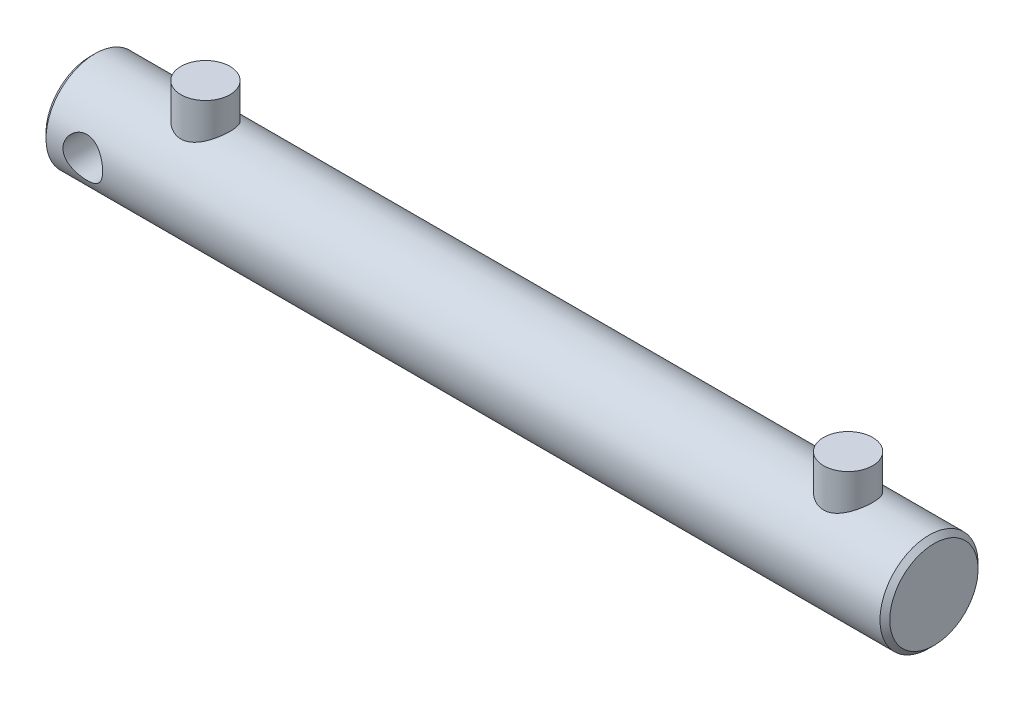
from build123d import *

# Parameters (mm, degrees)
ESQUISSE1_W                  = 344
ESQUISSE1_H                  = 20
CHANFREIN1_SIZE              = 2
ENL_V_MAT_EXTRU_1_DEPTH      = 175.310068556
ENL_V_MAT_EXTRU_1_DEPTH_BACK = 175.310068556
ESQUISSE3_R                  = 8.1
ESQUISSE5_R                  = 10
EXTRUSION2_DEPTH             = 33


with BuildPart() as part:
    # Esquisse1 → R_volution1 (revolve)
    with BuildSketch(Plane.XY, mode=Mode.PRIVATE) as r_volution1_sk:
        with Locations((0, 10)):
            Rectangle(ESQUISSE1_W, ESQUISSE1_H)
    revolve(r_volution1_sk.sketch.rotate(Axis((-172, 0, 0), (1, 0, 0)), 90), axis=Axis((-172, 0, 0), (1, 0, 0)))

    # Chanfrein1
    chanfrein1_edges = [part.edges().sort_by_distance(p)[0] for p in [
        (172, 0, -20),
        (-172, 0, -20),
    ]]
    chamfer(chanfrein1_edges, length=CHANFREIN1_SIZE)

    # Esquisse3 → Enl_v. mat.-Extru.1 (cut, two sides: drawn at the far end of the back side and taken through both)
    with BuildSketch(Plane.XY.offset(-ENL_V_MAT_EXTRU_1_DEPTH_BACK)):
        with Locations((-155, 0)):
            Circle(ESQUISSE3_R)
    extrude(amount=ENL_V_MAT_EXTRU_1_DEPTH + ENL_V_MAT_EXTRU_1_DEPTH_BACK, mode=Mode.SUBTRACT)

    # Esquisse5 → Extrusion2 (add)
    with BuildSketch(Plane(origin=(0, 0, 0), x_dir=(1, 0, 0), z_dir=(0, 1, 0))):
        with Locations(Location((-125, 0, 0), (0, 0, 90))):
            Circle(ESQUISSE5_R)
        with Locations(Location((137, 0, 0), (0, 0, 90))):
            Circle(ESQUISSE5_R)
    extrude(amount=EXTRUSION2_DEPTH)


solid = part.part
